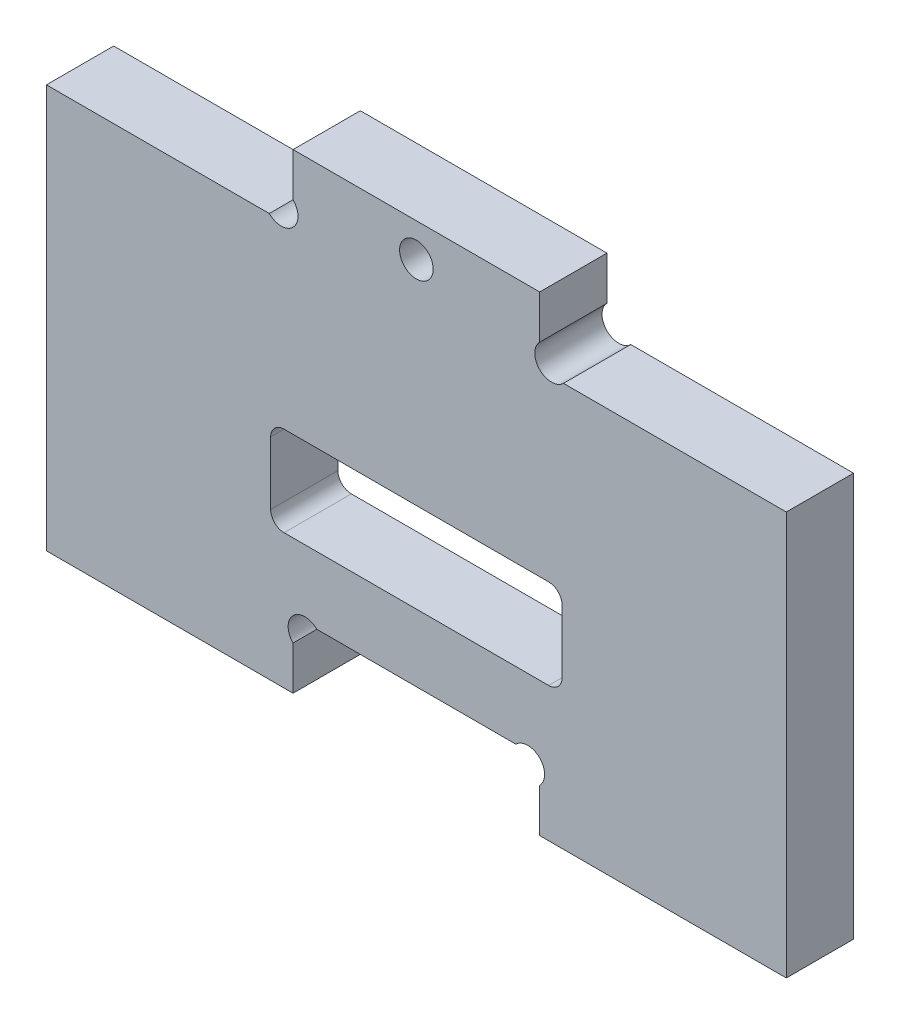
from build123d import *

# Parameters (mm, degrees)
ESQUISSE1_R      = 1.5
EXTRUSION1_DEPTH = 6


with BuildPart() as part:
    # Esquisse1 → Extrusion1 (new body)
    with BuildSketch(Plane.XY):
        with BuildLine():
            Line((22, 38.121320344), (22, 42))
            Line((22, 42), (44, 42))
            Line((44, 42), (44, 38.121320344))
            ThreePointArc((44, 38.121320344), (44, 36), (46.121320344, 36))
            Line((46.121320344, 36), (66, 36))
            Line((66, 36), (66, 0))
            Line((66, 0), (44, 0))
            Line((44, 0), (44, 3.878679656))
            ThreePointArc((44, 3.878679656), (44, 6), (41.878679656, 6))
            Line((41.878679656, 6), (24.121320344, 6))
            ThreePointArc((24.121320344, 6), (22, 6), (22, 3.878679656))
            Line((22, 3.878679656), (22, 0))
            Line((22, 0), (0, 0))
            Line((0, 0), (0, 36))
            Line((0, 36), (19.878679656, 36))
            ThreePointArc((19.878679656, 36), (22, 36), (22, 38.121320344))
        make_face()
        with Locations((33, 39)):
            Circle(ESQUISSE1_R, mode=Mode.SUBTRACT)
        with BuildLine():
            Line((46, 18.8), (46, 13.2))
            ThreePointArc((46, 13.2), (45.648528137, 12.351471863), (44.8, 12))
            Line((44.8, 12), (21.2, 12))
            ThreePointArc((21.2, 12), (20.351471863, 12.351471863), (20, 13.2))
            Line((20, 13.2), (20, 18.8))
            ThreePointArc((20, 18.8), (20.351471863, 19.648528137), (21.2, 20))
            Line((21.2, 20), (44.8, 20))
            ThreePointArc((44.8, 20), (45.648528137, 19.648528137), (46, 18.8))
        make_face(mode=Mode.SUBTRACT)
    extrude(amount=EXTRUSION1_DEPTH)


solid = part.part
